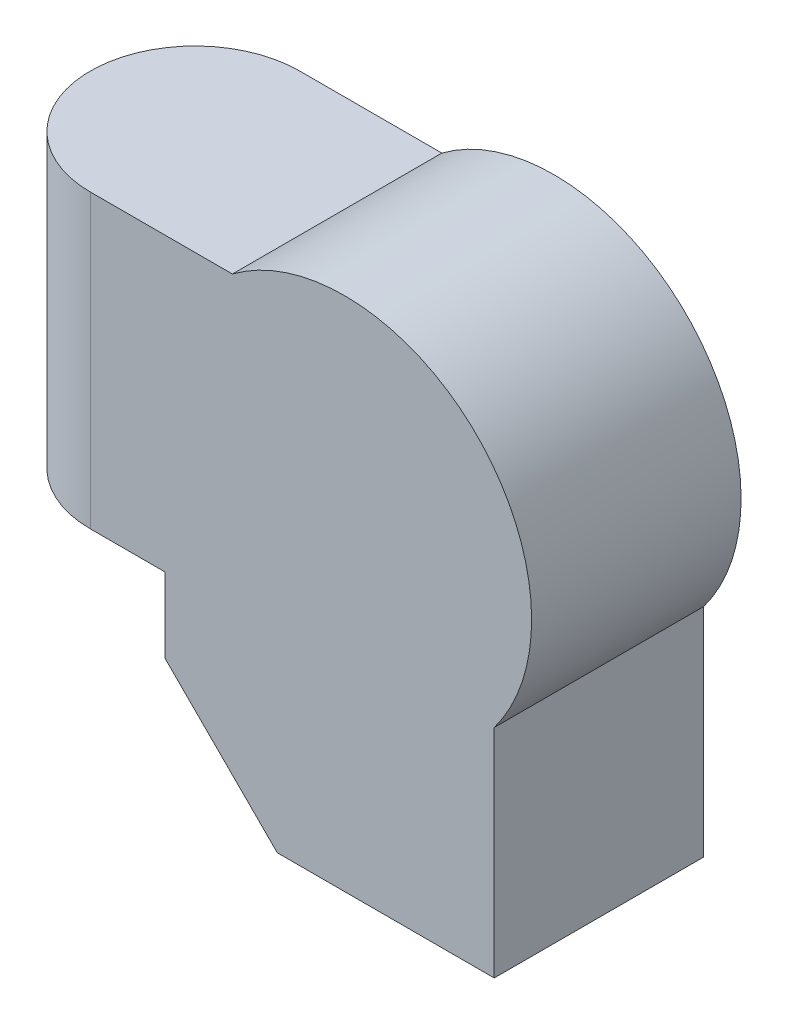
from build123d import *

# Parameters (mm, degrees)
EXTRUSION1_DEPTH        = 28
ENL_V_MAT_EXTRU_1_DEPTH = 85.758480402


with BuildPart() as part:
    # Esquisse1 → Extrusion1 (new body)
    with BuildSketch(Plane.XY):
        with BuildLine():
            Line((20, -44), (20, -15))
            ThreePointArc((20, -15), (17.67766953, 17.67766953), (-15, 20))
            Line((-15, 20), (-48, 20))
            Line((-48, 20), (-48, -19))
            Line((-48, -19), (-24, -19))
            Line((-24, -19), (-24, -29))
            Line((-24, -29), (-9, -44))
            Line((-9, -44), (20, -44))
        make_face()
    extrude(amount=EXTRUSION1_DEPTH)

    # Esquisse2 → Enl_v. mat.-Extru.1 (cut, through all)
    with BuildSketch(Plane(origin=(0, 20, 0), x_dir=(-1, 0, 0), z_dir=(0, 1, 0))):
        with BuildLine():
            Line((34, 28), (34, 34))
            Line((34, 34), (50, 34))
            Line((50, 34), (50, -6))
            Line((50, -6), (34, -6))
            Line((34, -6), (34, 0))
            ThreePointArc((34, 0), (48, 14), (34, 28))
        make_face()
    extrude(amount=-ENL_V_MAT_EXTRU_1_DEPTH, mode=Mode.SUBTRACT)


solid = part.part
